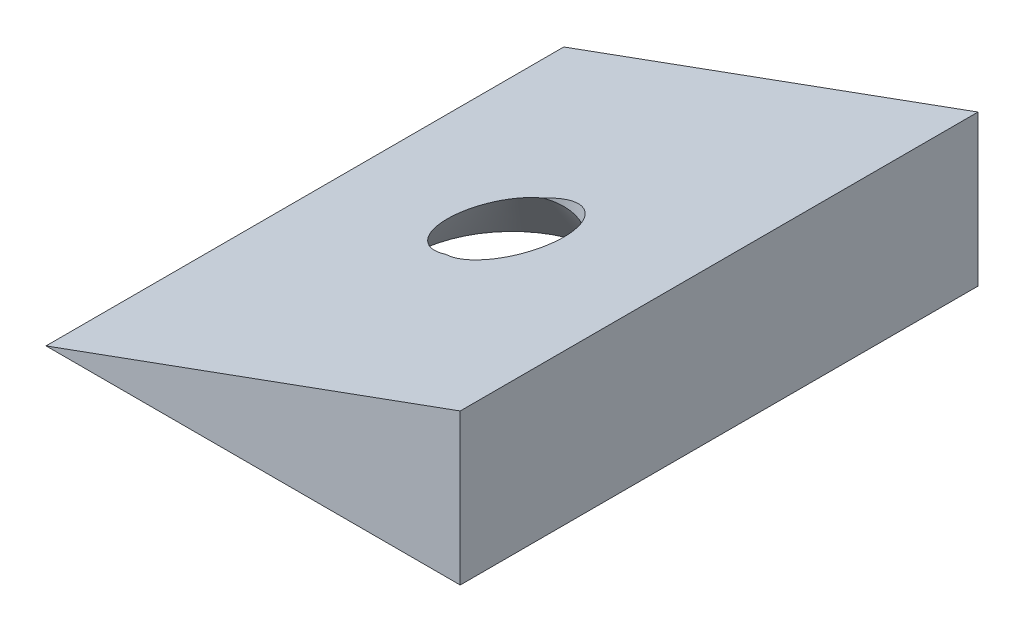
ISO-10303-21;
HEADER;
FILE_DESCRIPTION(('STEP AP214'),'2;1');
FILE_NAME('part.step','',(''),(''),'','','');
FILE_SCHEMA(('AUTOMOTIVE_DESIGN { 1 0 10303 214 1 1 1 1 }'));
ENDSEC;
DATA;
#1=APPLICATION_CONTEXT('core data for automotive mechanical design processes');
#2=APPLICATION_PROTOCOL_DEFINITION('international standard','automotive_design',2000,#1);
#3=PRODUCT_CONTEXT('',#1,'mechanical');
#4=PRODUCT('Part','Part','',(#3));
#5=PRODUCT_RELATED_PRODUCT_CATEGORY('part','',(#4));
#6=PRODUCT_DEFINITION_FORMATION('','',#4);
#7=PRODUCT_DEFINITION_CONTEXT('part definition',#1,'design');
#8=PRODUCT_DEFINITION('design','',#6,#7);
#9=PRODUCT_DEFINITION_SHAPE('','',#8);
#10=(LENGTH_UNIT() NAMED_UNIT(*) SI_UNIT(.MILLI.,.METRE.));
#11=(NAMED_UNIT(*) PLANE_ANGLE_UNIT() SI_UNIT($,.RADIAN.));
#12=(NAMED_UNIT(*) SI_UNIT($,.STERADIAN.) SOLID_ANGLE_UNIT());
#13=UNCERTAINTY_MEASURE_WITH_UNIT(LENGTH_MEASURE(1.E-05),#10,'distance_accuracy_value','');
#14=(GEOMETRIC_REPRESENTATION_CONTEXT(3) GLOBAL_UNCERTAINTY_ASSIGNED_CONTEXT((#13)) GLOBAL_UNIT_ASSIGNED_CONTEXT((#10,
#11,#12)) REPRESENTATION_CONTEXT('',''));
#15=CARTESIAN_POINT('',(0.,0.,0.));
#16=DIRECTION('',(0.,0.,1.));
#17=DIRECTION('',(1.,0.,0.));
#18=AXIS2_PLACEMENT_3D('',#15,#16,#17);
#19=CARTESIAN_POINT('',(24.6060379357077,2.33239716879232,26.5500038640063));
#20=DIRECTION('',(0.,0.,-1.));
#21=DIRECTION('',(-1.,0.,0.));
#22=AXIS2_PLACEMENT_3D('',#19,#20,#21);
#23=PLANE('',#22);
#24=DIRECTION('',(0.,-1.,0.));
#25=VECTOR('',#24,1.);
#26=CARTESIAN_POINT('',(24.6060379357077,4.51621975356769,26.5500038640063));
#27=LINE('',#26,#25);
#28=CARTESIAN_POINT('',(24.6060379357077,6.70004233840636,26.5500038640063));
#29=VERTEX_POINT('',#28);
#30=CARTESIAN_POINT('',(24.6060379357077,2.33239716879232,26.5500038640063));
#31=VERTEX_POINT('',#30);
#32=EDGE_CURVE('E91',#29,#31,#27,.T.);
#33=ORIENTED_EDGE('',*,*,#32,.F.);
#34=DIRECTION('',(0.939692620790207,0.342020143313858,0.));
#35=VECTOR('',#34,1.);
#36=CARTESIAN_POINT('',(18.6060346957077,4.51621975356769,26.5500038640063));
#37=LINE('',#36,#35);
#38=CARTESIAN_POINT('',(12.6060314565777,2.33239716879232,26.5500038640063));
#39=VERTEX_POINT('',#38);
#40=EDGE_CURVE('E79',#39,#29,#37,.T.);
#41=ORIENTED_EDGE('',*,*,#40,.F.);
#42=DIRECTION('',(-1.,0.,0.));
#43=VECTOR('',#42,1.);
#44=CARTESIAN_POINT('',(18.6060346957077,2.33239716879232,26.5500038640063));
#45=LINE('',#44,#43);
#46=EDGE_CURVE('E99',#31,#39,#45,.T.);
#47=ORIENTED_EDGE('',*,*,#46,.F.);
#48=EDGE_LOOP('',(#33,#41,#47));
#49=FACE_BOUND('',#48,.T.);
#50=ADVANCED_FACE('F34',(#49),#23,.F.);
#51=CARTESIAN_POINT('',(24.6060379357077,2.33239716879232,26.5500038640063));
#52=DIRECTION('',(1.,0.,0.));
#53=DIRECTION('',(0.,0.,-1.));
#54=AXIS2_PLACEMENT_3D('',#51,#52,#53);
#55=PLANE('',#54);
#56=DIRECTION('',(0.,0.,-1.));
#57=VECTOR('',#56,1.);
#58=CARTESIAN_POINT('',(24.6060379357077,6.70004233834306,19.0499998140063));
#59=LINE('',#58,#57);
#60=CARTESIAN_POINT('',(24.6060379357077,6.70004233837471,11.5499957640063));
#61=VERTEX_POINT('',#60);
#62=EDGE_CURVE('E72',#29,#61,#59,.T.);
#63=ORIENTED_EDGE('',*,*,#62,.F.);
#64=ORIENTED_EDGE('',*,*,#32,.T.);
#65=DIRECTION('',(0.,0.,1.));
#66=VECTOR('',#65,1.);
#67=CARTESIAN_POINT('',(24.6060379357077,2.33239716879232,19.0499998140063));
#68=LINE('',#67,#66);
#69=CARTESIAN_POINT('',(24.6060379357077,2.33239716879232,11.5499957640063));
#70=VERTEX_POINT('',#69);
#71=EDGE_CURVE('E87',#70,#31,#68,.T.);
#72=ORIENTED_EDGE('',*,*,#71,.F.);
#73=DIRECTION('',(0.,1.,0.));
#74=VECTOR('',#73,1.);
#75=CARTESIAN_POINT('',(24.6060379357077,4.52932268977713,11.5499957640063));
#76=LINE('',#75,#74);
#77=EDGE_CURVE('E84',#70,#61,#76,.T.);
#78=ORIENTED_EDGE('',*,*,#77,.T.);
#79=EDGE_LOOP('',(#63,#64,#72,#78));
#80=FACE_BOUND('',#79,.T.);
#81=ADVANCED_FACE('F85',(#80),#55,.T.);
#82=CARTESIAN_POINT('',(12.5340314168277,2.33239716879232,11.5499957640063));
#83=DIRECTION('',(0.,0.,1.));
#84=DIRECTION('',(1.,0.,0.));
#85=AXIS2_PLACEMENT_3D('',#82,#83,#84);
#86=PLANE('',#85);
#87=DIRECTION('',(-0.939692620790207,-0.342020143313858,0.));
#88=VECTOR('',#87,1.);
#89=CARTESIAN_POINT('',(18.6060346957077,4.51621975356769,11.5499957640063));
#90=LINE('',#89,#88);
#91=CARTESIAN_POINT('',(12.6060314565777,2.33239716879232,11.5499957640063));
#92=VERTEX_POINT('',#91);
#93=EDGE_CURVE('E76',#61,#92,#90,.T.);
#94=ORIENTED_EDGE('',*,*,#93,.F.);
#95=ORIENTED_EDGE('',*,*,#77,.F.);
#96=DIRECTION('',(1.,0.,0.));
#97=VECTOR('',#96,1.);
#98=CARTESIAN_POINT('',(18.6060346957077,2.33239716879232,11.5499957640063));
#99=LINE('',#98,#97);
#100=EDGE_CURVE('E90',#92,#70,#99,.T.);
#101=ORIENTED_EDGE('',*,*,#100,.F.);
#102=EDGE_LOOP('',(#94,#95,#101));
#103=FACE_BOUND('',#102,.T.);
#104=ADVANCED_FACE('F93',(#103),#86,.F.);
#105=CARTESIAN_POINT('',(12.6060314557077,2.33239716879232,26.5500038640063));
#106=DIRECTION('',(0.,-1.,0.));
#107=DIRECTION('',(0.,0.,-1.));
#108=AXIS2_PLACEMENT_3D('',#105,#106,#107);
#109=PLANE('',#108);
#110=CARTESIAN_POINT('',(18.6060346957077,2.33239716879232,19.0499998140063));
#111=DIRECTION('',(0.,-1.,0.));
#112=DIRECTION('',(0.,0.,-1.));
#113=AXIS2_PLACEMENT_3D('',#110,#111,#112);
#114=CIRCLE('',#113,3.00000162);
#115=CARTESIAN_POINT('',(18.6060346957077,2.33239716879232,16.0499981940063));
#116=VERTEX_POINT('',#115);
#117=EDGE_CURVE('E95',#116,#116,#114,.T.);
#118=ORIENTED_EDGE('',*,*,#117,.F.);
#119=EDGE_LOOP('',(#118));
#120=FACE_BOUND('',#119,.T.);
#121=ORIENTED_EDGE('',*,*,#71,.T.);
#122=ORIENTED_EDGE('',*,*,#46,.T.);
#123=DIRECTION('',(0.,0.,1.));
#124=VECTOR('',#123,1.);
#125=CARTESIAN_POINT('',(12.6060314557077,2.33239716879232,19.0499998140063));
#126=LINE('',#125,#124);
#127=EDGE_CURVE('E98',#92,#39,#126,.T.);
#128=ORIENTED_EDGE('',*,*,#127,.F.);
#129=ORIENTED_EDGE('',*,*,#100,.T.);
#130=EDGE_LOOP('',(#121,#122,#128,#129));
#131=FACE_BOUND('',#130,.T.);
#132=ADVANCED_FACE('F113',(#120,#131),#109,.T.);
#133=CARTESIAN_POINT('',(24.6060379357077,6.70004233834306,11.5499957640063));
#134=DIRECTION('',(-0.342020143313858,0.939692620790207,0.));
#135=DIRECTION('',(-0.939692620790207,-0.342020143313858,0.));
#136=AXIS2_PLACEMENT_3D('',#133,#134,#135);
#137=PLANE('',#136);
#138=CARTESIAN_POINT('',(18.2042636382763,4.36998704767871,19.0499998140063));
#139=DIRECTION('',(-0.342020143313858,0.939692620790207,0.));
#140=DIRECTION('',(-0.939692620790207,-0.342020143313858,0.));
#141=AXIS2_PLACEMENT_3D('',#138,#139,#140);
#142=ELLIPSE('',#141,1.56626664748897,1.41591043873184);
#143=CARTESIAN_POINT('',(18.1009892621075,4.33239824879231,17.6375793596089));
#144=VERTEX_POINT('',#143);
#145=CARTESIAN_POINT('',(18.1009892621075,4.33239824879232,20.4624202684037));
#146=VERTEX_POINT('',#145);
#147=EDGE_CURVE('E44',#144,#146,#142,.T.);
#148=ORIENTED_EDGE('',*,*,#147,.F.);
#149=CARTESIAN_POINT('',(18.6060346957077,4.51621975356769,19.0499998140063));
#150=DIRECTION('',(-0.342020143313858,0.939692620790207,0.));
#151=DIRECTION('',(-0.939692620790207,-0.342020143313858,0.));
#152=AXIS2_PLACEMENT_3D('',#149,#150,#151);
#153=ELLIPSE('',#152,1.59626752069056,1.50000081);
#154=EDGE_CURVE('E38',#144,#146,#153,.F.);
#155=ORIENTED_EDGE('',*,*,#154,.T.);
#156=EDGE_LOOP('',(#148,#155));
#157=FACE_BOUND('',#156,.T.);
#158=ORIENTED_EDGE('',*,*,#62,.T.);
#159=ORIENTED_EDGE('',*,*,#93,.T.);
#160=ORIENTED_EDGE('',*,*,#127,.T.);
#161=ORIENTED_EDGE('',*,*,#40,.T.);
#162=EDGE_LOOP('',(#158,#159,#160,#161));
#163=FACE_BOUND('',#162,.T.);
#164=ADVANCED_FACE('F36',(#157,#163),#137,.T.);
#165=CARTESIAN_POINT('',(18.6060346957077,4.33239824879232,19.0499998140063));
#166=DIRECTION('',(0.,-1.,0.));
#167=DIRECTION('',(0.,0.,-1.));
#168=AXIS2_PLACEMENT_3D('',#165,#166,#167);
#169=CONICAL_SURFACE('',#168,1.50000081,0.643501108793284);
#170=ORIENTED_EDGE('',*,*,#117,.T.);
#171=EDGE_LOOP('',(#170));
#172=FACE_BOUND('',#171,.T.);
#173=CARTESIAN_POINT('',(18.6060346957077,4.33239824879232,19.0499998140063));
#174=DIRECTION('',(0.,-1.,0.));
#175=DIRECTION('',(0.,0.,-1.));
#176=AXIS2_PLACEMENT_3D('',#173,#174,#175);
#177=CIRCLE('',#176,1.50000081);
#178=EDGE_CURVE('E11',#144,#146,#177,.T.);
#179=ORIENTED_EDGE('',*,*,#178,.F.);
#180=ORIENTED_EDGE('',*,*,#147,.T.);
#181=EDGE_LOOP('',(#179,#180));
#182=FACE_BOUND('',#181,.T.);
#183=ADVANCED_FACE('F110',(#172,#182),#169,.F.);
#184=CARTESIAN_POINT('',(18.6060346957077,4.51732268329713,19.0499998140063));
#185=DIRECTION('',(0.,-1.,0.));
#186=DIRECTION('',(1.,0.,0.));
#187=AXIS2_PLACEMENT_3D('',#184,#185,#186);
#188=CYLINDRICAL_SURFACE('',#187,1.50000081);
#189=ORIENTED_EDGE('',*,*,#154,.F.);
#190=ORIENTED_EDGE('',*,*,#178,.T.);
#191=EDGE_LOOP('',(#189,#190));
#192=FACE_BOUND('',#191,.T.);
#193=ADVANCED_FACE('F125',(#192),#188,.F.);
#194=CLOSED_SHELL('',(#50,#81,#104,#132,#164,#183,#193));
#195=MANIFOLD_SOLID_BREP('B2',#194);
#196=ADVANCED_BREP_SHAPE_REPRESENTATION('',(#18,#195),#14);
#197=SHAPE_DEFINITION_REPRESENTATION(#9,#196);
ENDSEC;
END-ISO-10303-21;
